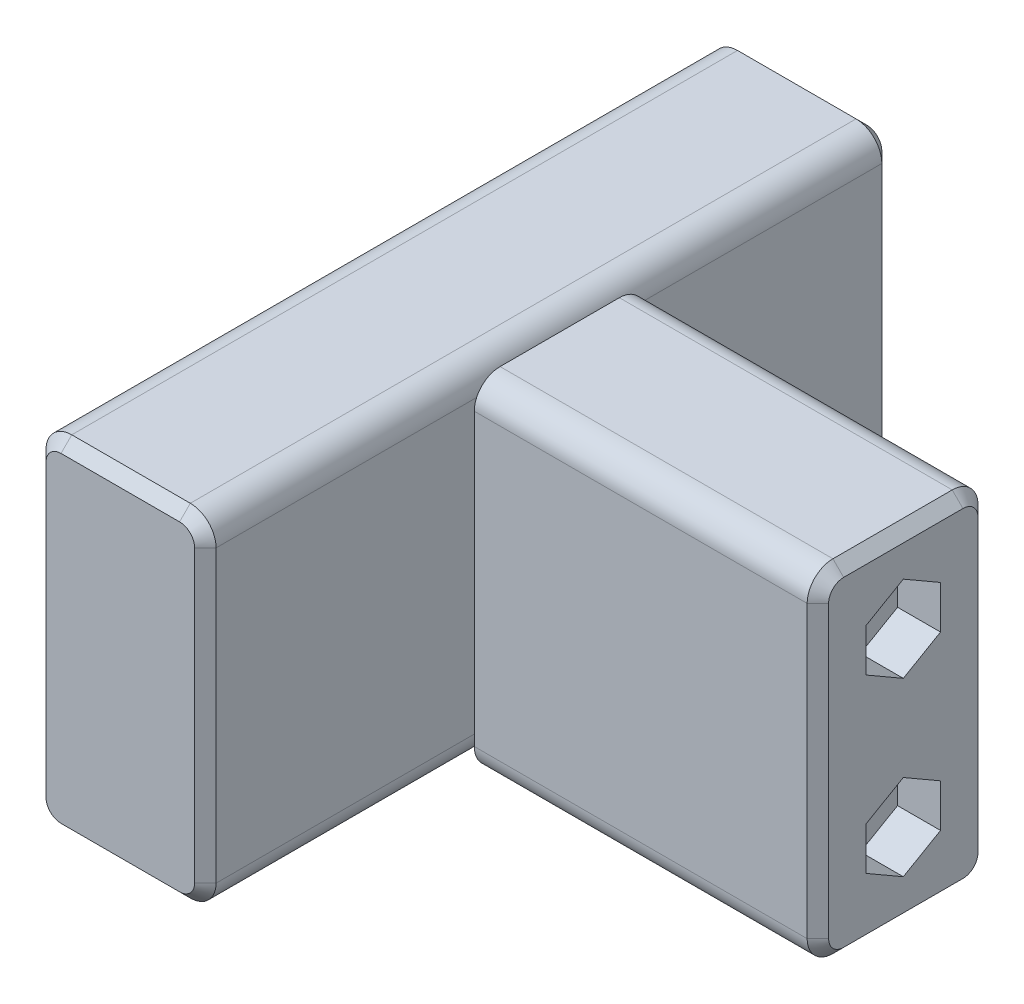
from build123d import *

# Parameters (mm, degrees)
BOSS_EXTRUDE1_DEPTH = 50.8
BOSS_EXTRUDE2_START = 1.5875
BOSS_EXTRUDE2_DEPTH = 50.8
SKETCH3_R           = 3.175
CUT_EXTRUDE1_DEPTH  = 97.077094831
CUT_EXTRUDE2_DEPTH  = 6.35
CHAMFER1_SIZE       = 1.5875
CHAMFER2_SIZE       = 1.5875


with BuildPart() as part:
    # Sketch1 → Boss-Extrude1 (new, symmetric)
    with BuildSketch(Plane.XY):
        with BuildLine():
            Line((-8.763, -25.273), (8.763, -25.273))
            ThreePointArc((8.763, -25.273), (11.457076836, -24.157076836), (12.573, -21.463))
            Line((12.573, -21.463), (12.573, 21.463))
            ThreePointArc((12.573, 21.463), (11.457076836, 24.157076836), (8.763, 25.273))
            Line((8.763, 25.273), (-8.763, 25.273))
            ThreePointArc((-8.763, 25.273), (-11.457076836, 24.157076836), (-12.573, 21.463))
            Line((-12.573, 21.463), (-12.573, -21.463))
            ThreePointArc((-12.573, -21.463), (-11.457076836, -24.157076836), (-8.763, -25.273))
        make_face()
    extrude(amount=BOSS_EXTRUDE1_DEPTH, both=True)


with BuildPart() as body_2:
    # Sketch2 → Boss-Extrude2 (new body)
    with BuildSketch(Plane(origin=(12.573, 0, 0), x_dir=(0, 0, -1), z_dir=(1, 0, 0)).offset(BOSS_EXTRUDE2_START)):
        with BuildLine():
            Line((-8.8185, -25.273), (8.8185, -25.273))
            ThreePointArc((8.8185, -25.273), (11.512576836, -24.157076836), (12.6285, -21.463))
            Line((12.6285, -21.463), (12.6285, 21.463))
            ThreePointArc((12.6285, 21.463), (11.512576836, 24.157076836), (8.8185, 25.273))
            Line((8.8185, 25.273), (-8.8185, 25.273))
            ThreePointArc((-8.8185, 25.273), (-11.512576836, 24.157076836), (-12.6285, 21.463))
            Line((-12.6285, 21.463), (-12.6285, -21.463))
            ThreePointArc((-12.6285, -21.463), (-11.512576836, -24.157076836), (-8.8185, -25.273))
        make_face()
    extrude(amount=BOSS_EXTRUDE2_DEPTH)


with BuildPart() as cut_extrude1_tool:
    # Sketch3 → Cut-Extrude1 (new, through all)
    with BuildSketch(Plane.ZY.offset(12.573)):
        with Locations((0, 12.7)):
            Circle(SKETCH3_R)
        with Locations((0, -12.7)):
            Circle(SKETCH3_R)
    extrude(amount=-CUT_EXTRUDE1_DEPTH)


with BuildPart() as part_1:
    add(part.part)

    # Cut-Extrude1: cut by cut_extrude1_tool
    add(cut_extrude1_tool.part, mode=Mode.SUBTRACT)

    # Chamfer2
    chamfer2_edges = [part_1.edges().sort_by_distance(p)[0] for p in [
        (12.573, 0, -50.8),
        (11.457076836, -24.157076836, -50.8),
        (0, -25.273, -50.8),
        (-11.457076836, -24.157076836, -50.8),
        (11.457076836, -24.157076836, 50.8),
        (12.573, 0, 50.8),
        (11.457076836, 24.157076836, 50.8),
        (0, 25.273, 50.8),
        (-11.457076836, 24.157076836, 50.8),
        (-12.573, 0, 50.8),
        (-11.457076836, -24.157076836, 50.8),
        (-12.573, 0, -50.8),
        (0, -25.273, 50.8),
        (-11.457076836, 24.157076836, -50.8),
        (0, 25.273, -50.8),
        (11.457076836, 24.157076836, -50.8),
    ]]
    chamfer(chamfer2_edges, length=CHAMFER2_SIZE)


with BuildPart() as body_2_1:
    add(body_2.part)

    # Cut-Extrude1: cut by cut_extrude1_tool
    add(cut_extrude1_tool.part, mode=Mode.SUBTRACT)

    # Sketch4 → Cut-Extrude2 (cut)
    with BuildSketch(Plane(origin=(64.9605, 0, 0), x_dir=(0, 0, -1), z_dir=(1, 0, 0))):
        Polygon((0, 19.050852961), (-5.5, 15.875426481), (-5.5, 9.524573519), (0, 6.349147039), (5.5, 9.524573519), (5.5, 15.875426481), align=None)
        Polygon((0, -6.349147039), (-5.5, -9.524573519), (-5.5, -15.875426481), (0, -19.050852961), (5.5, -15.875426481), (5.5, -9.524573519), align=None)
    extrude(amount=-CUT_EXTRUDE2_DEPTH, mode=Mode.SUBTRACT)

    # Chamfer1
    chamfer1_edges = [body_2_1.edges().sort_by_distance(p)[0] for p in [
        (64.9605, -24.157076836, -11.512576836),
        (64.9605, 0, -12.6285),
        (64.9605, 24.157076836, -11.512576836),
        (64.9605, 25.273, 0),
        (64.9605, 24.157076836, 11.512576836),
        (64.9605, 0, 12.6285),
        (64.9605, -24.157076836, 11.512576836),
        (64.9605, -25.273, 0),
    ]]
    chamfer(chamfer1_edges, length=CHAMFER1_SIZE)


solid = Compound([part_1.part, body_2_1.part])
